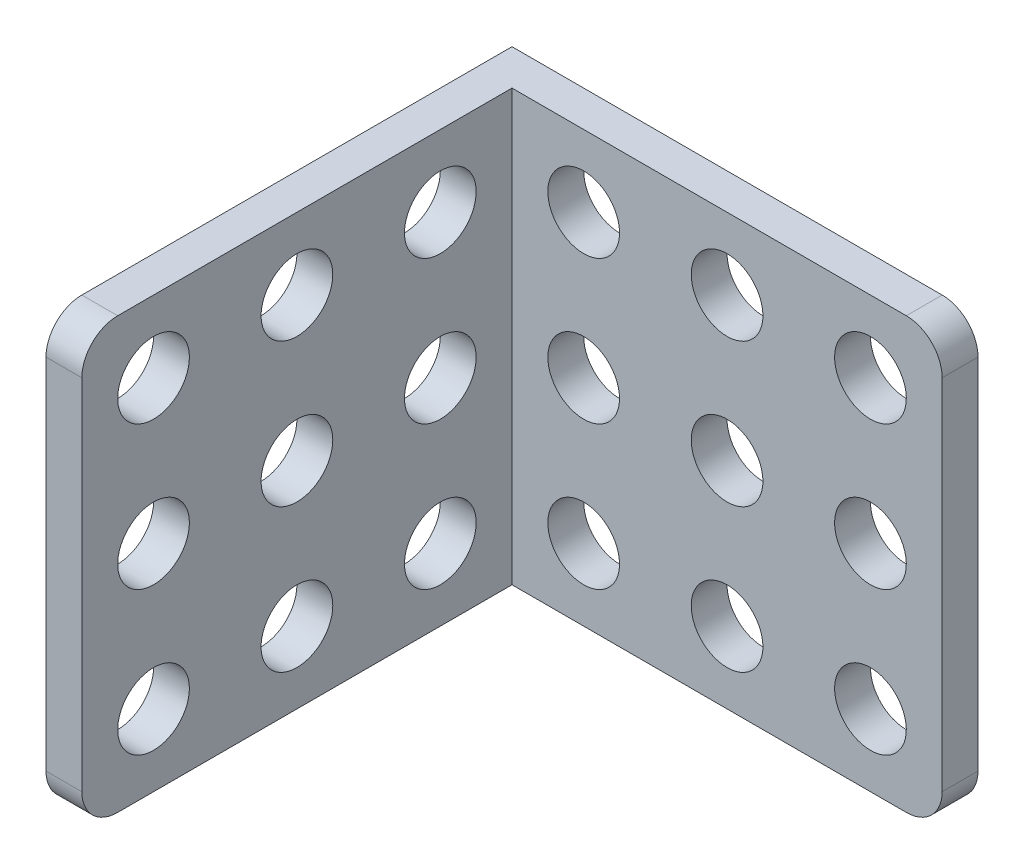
ISO-10303-21;
HEADER;
FILE_DESCRIPTION(('STEP AP214'),'2;1');
FILE_NAME('part.step','',(''),(''),'','','');
FILE_SCHEMA(('AUTOMOTIVE_DESIGN { 1 0 10303 214 1 1 1 1 }'));
ENDSEC;
DATA;
#1=APPLICATION_CONTEXT('core data for automotive mechanical design processes');
#2=APPLICATION_PROTOCOL_DEFINITION('international standard','automotive_design',2000,#1);
#3=PRODUCT_CONTEXT('',#1,'mechanical');
#4=PRODUCT('Part','Part','',(#3));
#5=PRODUCT_RELATED_PRODUCT_CATEGORY('part','',(#4));
#6=PRODUCT_DEFINITION_FORMATION('','',#4);
#7=PRODUCT_DEFINITION_CONTEXT('part definition',#1,'design');
#8=PRODUCT_DEFINITION('design','',#6,#7);
#9=PRODUCT_DEFINITION_SHAPE('','',#8);
#10=(LENGTH_UNIT() NAMED_UNIT(*) SI_UNIT(.MILLI.,.METRE.));
#11=(NAMED_UNIT(*) PLANE_ANGLE_UNIT() SI_UNIT($,.RADIAN.));
#12=(NAMED_UNIT(*) SI_UNIT($,.STERADIAN.) SOLID_ANGLE_UNIT());
#13=UNCERTAINTY_MEASURE_WITH_UNIT(LENGTH_MEASURE(1.E-05),#10,'distance_accuracy_value','');
#14=(GEOMETRIC_REPRESENTATION_CONTEXT(3) GLOBAL_UNCERTAINTY_ASSIGNED_CONTEXT((#13)) GLOBAL_UNIT_ASSIGNED_CONTEXT((#10,
#11,#12)) REPRESENTATION_CONTEXT('',''));
#15=CARTESIAN_POINT('',(0.,0.,0.));
#16=DIRECTION('',(0.,0.,1.));
#17=DIRECTION('',(1.,0.,0.));
#18=AXIS2_PLACEMENT_3D('',#15,#16,#17);
#19=CARTESIAN_POINT('',(13.,12.,2.));
#20=DIRECTION('',(-1.,0.,0.));
#21=DIRECTION('',(0.,-1.,0.));
#22=AXIS2_PLACEMENT_3D('',#19,#20,#21);
#23=PLANE('',#22);
#24=DIRECTION('',(0.,1.,0.));
#25=VECTOR('',#24,1.);
#26=CARTESIAN_POINT('',(13.,12.,2.));
#27=LINE('',#26,#25);
#28=CARTESIAN_POINT('',(13.,-10.,2.));
#29=VERTEX_POINT('',#28);
#30=CARTESIAN_POINT('',(13.,10.,2.));
#31=VERTEX_POINT('',#30);
#32=EDGE_CURVE('E134',#29,#31,#27,.T.);
#33=ORIENTED_EDGE('',*,*,#32,.F.);
#34=DIRECTION('',(0.,0.,-1.));
#35=VECTOR('',#34,1.);
#36=CARTESIAN_POINT('',(13.,-10.,2.));
#37=LINE('',#36,#35);
#38=CARTESIAN_POINT('',(13.,-10.,0.));
#39=VERTEX_POINT('',#38);
#40=EDGE_CURVE('E169',#29,#39,#37,.T.);
#41=ORIENTED_EDGE('',*,*,#40,.T.);
#42=DIRECTION('',(0.,1.,0.));
#43=VECTOR('',#42,1.);
#44=CARTESIAN_POINT('',(13.,12.,0.));
#45=LINE('',#44,#43);
#46=CARTESIAN_POINT('',(13.,10.,0.));
#47=VERTEX_POINT('',#46);
#48=EDGE_CURVE('E149',#39,#47,#45,.T.);
#49=ORIENTED_EDGE('',*,*,#48,.T.);
#50=DIRECTION('',(0.,0.,-1.));
#51=VECTOR('',#50,1.);
#52=CARTESIAN_POINT('',(13.,10.,2.));
#53=LINE('',#52,#51);
#54=EDGE_CURVE('E167',#47,#31,#53,.F.);
#55=ORIENTED_EDGE('',*,*,#54,.T.);
#56=EDGE_LOOP('',(#33,#41,#49,#55));
#57=FACE_BOUND('',#56,.T.);
#58=ADVANCED_FACE('F35',(#57),#23,.F.);
#59=CARTESIAN_POINT('',(-13.,12.,2.));
#60=DIRECTION('',(0.,-1.,0.));
#61=DIRECTION('',(0.,0.,-1.));
#62=AXIS2_PLACEMENT_3D('',#59,#60,#61);
#63=PLANE('',#62);
#64=DIRECTION('',(-1.,0.,0.));
#65=VECTOR('',#64,1.);
#66=CARTESIAN_POINT('',(-13.,12.,2.));
#67=LINE('',#66,#65);
#68=CARTESIAN_POINT('',(11.,12.,2.));
#69=VERTEX_POINT('',#68);
#70=CARTESIAN_POINT('',(-11.,12.,2.));
#71=VERTEX_POINT('',#70);
#72=EDGE_CURVE('E115',#69,#71,#67,.T.);
#73=ORIENTED_EDGE('',*,*,#72,.F.);
#74=DIRECTION('',(0.,0.,-1.));
#75=VECTOR('',#74,1.);
#76=CARTESIAN_POINT('',(11.,12.,2.));
#77=LINE('',#76,#75);
#78=CARTESIAN_POINT('',(11.,12.,0.));
#79=VERTEX_POINT('',#78);
#80=EDGE_CURVE('E184',#69,#79,#77,.T.);
#81=ORIENTED_EDGE('',*,*,#80,.T.);
#82=DIRECTION('',(-1.,0.,0.));
#83=VECTOR('',#82,1.);
#84=CARTESIAN_POINT('',(-13.,12.,0.));
#85=LINE('',#84,#83);
#86=CARTESIAN_POINT('',(-13.,12.,0.));
#87=VERTEX_POINT('',#86);
#88=EDGE_CURVE('E156',#79,#87,#85,.T.);
#89=ORIENTED_EDGE('',*,*,#88,.T.);
#90=DIRECTION('',(0.,0.,-1.));
#91=VECTOR('',#90,1.);
#92=CARTESIAN_POINT('',(-13.,12.,2.));
#93=LINE('',#92,#91);
#94=CARTESIAN_POINT('',(-13.,12.,24.));
#95=VERTEX_POINT('',#94);
#96=EDGE_CURVE('E165',#95,#87,#93,.T.);
#97=ORIENTED_EDGE('',*,*,#96,.F.);
#98=DIRECTION('',(-1.,0.,0.));
#99=VECTOR('',#98,1.);
#100=CARTESIAN_POINT('',(-11.,12.,24.));
#101=LINE('',#100,#99);
#102=CARTESIAN_POINT('',(-11.,12.,24.));
#103=VERTEX_POINT('',#102);
#104=EDGE_CURVE('E119',#95,#103,#101,.F.);
#105=ORIENTED_EDGE('',*,*,#104,.T.);
#106=DIRECTION('',(0.,0.,-1.));
#107=VECTOR('',#106,1.);
#108=CARTESIAN_POINT('',(-11.,12.,26.));
#109=LINE('',#108,#107);
#110=EDGE_CURVE('E111',#103,#71,#109,.T.);
#111=ORIENTED_EDGE('',*,*,#110,.T.);
#112=EDGE_LOOP('',(#73,#81,#89,#97,#105,#111));
#113=FACE_BOUND('',#112,.T.);
#114=ADVANCED_FACE('F113',(#113),#63,.F.);
#115=CARTESIAN_POINT('',(-13.,12.,2.));
#116=DIRECTION('',(1.,0.,0.));
#117=DIRECTION('',(0.,0.,-1.));
#118=AXIS2_PLACEMENT_3D('',#115,#116,#117);
#119=PLANE('',#118);
#120=CARTESIAN_POINT('',(-13.,0.,6.));
#121=DIRECTION('',(1.,0.,0.));
#122=DIRECTION('',(0.,0.,-1.));
#123=AXIS2_PLACEMENT_3D('',#120,#121,#122);
#124=CIRCLE('',#123,2.);
#125=CARTESIAN_POINT('',(-13.,0.,4.));
#126=VERTEX_POINT('',#125);
#127=EDGE_CURVE('E386',#126,#126,#124,.T.);
#128=ORIENTED_EDGE('',*,*,#127,.T.);
#129=EDGE_LOOP('',(#128));
#130=FACE_BOUND('',#129,.T.);
#131=CARTESIAN_POINT('',(-13.,0.,14.));
#132=DIRECTION('',(1.,0.,0.));
#133=DIRECTION('',(0.,0.,-1.));
#134=AXIS2_PLACEMENT_3D('',#131,#132,#133);
#135=CIRCLE('',#134,2.);
#136=CARTESIAN_POINT('',(-13.,0.,12.));
#137=VERTEX_POINT('',#136);
#138=EDGE_CURVE('E392',#137,#137,#135,.T.);
#139=ORIENTED_EDGE('',*,*,#138,.T.);
#140=EDGE_LOOP('',(#139));
#141=FACE_BOUND('',#140,.T.);
#142=CARTESIAN_POINT('',(-13.,0.,22.));
#143=DIRECTION('',(1.,0.,0.));
#144=DIRECTION('',(0.,0.,-1.));
#145=AXIS2_PLACEMENT_3D('',#142,#143,#144);
#146=CIRCLE('',#145,2.);
#147=CARTESIAN_POINT('',(-13.,0.,20.));
#148=VERTEX_POINT('',#147);
#149=EDGE_CURVE('E398',#148,#148,#146,.T.);
#150=ORIENTED_EDGE('',*,*,#149,.T.);
#151=EDGE_LOOP('',(#150));
#152=FACE_BOUND('',#151,.T.);
#153=CARTESIAN_POINT('',(-13.,8.,22.));
#154=DIRECTION('',(1.,0.,0.));
#155=DIRECTION('',(0.,0.,-1.));
#156=AXIS2_PLACEMENT_3D('',#153,#154,#155);
#157=CIRCLE('',#156,2.);
#158=CARTESIAN_POINT('',(-13.,8.,20.));
#159=VERTEX_POINT('',#158);
#160=EDGE_CURVE('E404',#159,#159,#157,.T.);
#161=ORIENTED_EDGE('',*,*,#160,.T.);
#162=EDGE_LOOP('',(#161));
#163=FACE_BOUND('',#162,.T.);
#164=CARTESIAN_POINT('',(-13.,8.,14.));
#165=DIRECTION('',(1.,0.,0.));
#166=DIRECTION('',(0.,0.,-1.));
#167=AXIS2_PLACEMENT_3D('',#164,#165,#166);
#168=CIRCLE('',#167,2.);
#169=CARTESIAN_POINT('',(-13.,8.,12.));
#170=VERTEX_POINT('',#169);
#171=EDGE_CURVE('E410',#170,#170,#168,.T.);
#172=ORIENTED_EDGE('',*,*,#171,.T.);
#173=EDGE_LOOP('',(#172));
#174=FACE_BOUND('',#173,.T.);
#175=CARTESIAN_POINT('',(-13.,8.,6.));
#176=DIRECTION('',(1.,0.,0.));
#177=DIRECTION('',(0.,0.,-1.));
#178=AXIS2_PLACEMENT_3D('',#175,#176,#177);
#179=CIRCLE('',#178,2.);
#180=CARTESIAN_POINT('',(-13.,8.,4.));
#181=VERTEX_POINT('',#180);
#182=EDGE_CURVE('E416',#181,#181,#179,.T.);
#183=ORIENTED_EDGE('',*,*,#182,.T.);
#184=EDGE_LOOP('',(#183));
#185=FACE_BOUND('',#184,.T.);
#186=CARTESIAN_POINT('',(-13.,-8.,6.));
#187=DIRECTION('',(1.,0.,0.));
#188=DIRECTION('',(0.,0.,-1.));
#189=AXIS2_PLACEMENT_3D('',#186,#187,#188);
#190=CIRCLE('',#189,2.);
#191=CARTESIAN_POINT('',(-13.,-8.,4.));
#192=VERTEX_POINT('',#191);
#193=EDGE_CURVE('E422',#192,#192,#190,.T.);
#194=ORIENTED_EDGE('',*,*,#193,.T.);
#195=EDGE_LOOP('',(#194));
#196=FACE_BOUND('',#195,.T.);
#197=CARTESIAN_POINT('',(-13.,-8.,14.));
#198=DIRECTION('',(1.,0.,0.));
#199=DIRECTION('',(0.,0.,-1.));
#200=AXIS2_PLACEMENT_3D('',#197,#198,#199);
#201=CIRCLE('',#200,2.);
#202=CARTESIAN_POINT('',(-13.,-8.,12.));
#203=VERTEX_POINT('',#202);
#204=EDGE_CURVE('E428',#203,#203,#201,.T.);
#205=ORIENTED_EDGE('',*,*,#204,.T.);
#206=EDGE_LOOP('',(#205));
#207=FACE_BOUND('',#206,.T.);
#208=CARTESIAN_POINT('',(-13.,-8.,22.));
#209=DIRECTION('',(1.,0.,0.));
#210=DIRECTION('',(0.,0.,-1.));
#211=AXIS2_PLACEMENT_3D('',#208,#209,#210);
#212=CIRCLE('',#211,2.);
#213=CARTESIAN_POINT('',(-13.,-8.,20.));
#214=VERTEX_POINT('',#213);
#215=EDGE_CURVE('E139',#214,#214,#212,.T.);
#216=ORIENTED_EDGE('',*,*,#215,.T.);
#217=EDGE_LOOP('',(#216));
#218=FACE_BOUND('',#217,.T.);
#219=DIRECTION('',(0.,-1.,0.));
#220=VECTOR('',#219,1.);
#221=CARTESIAN_POINT('',(-13.,12.,26.));
#222=LINE('',#221,#220);
#223=CARTESIAN_POINT('',(-13.,10.,26.));
#224=VERTEX_POINT('',#223);
#225=CARTESIAN_POINT('',(-13.,-10.,26.));
#226=VERTEX_POINT('',#225);
#227=EDGE_CURVE('E138',#224,#226,#222,.T.);
#228=ORIENTED_EDGE('',*,*,#227,.F.);
#229=CARTESIAN_POINT('',(-13.,10.,24.));
#230=DIRECTION('',(1.,0.,0.));
#231=DIRECTION('',(0.,0.,-1.));
#232=AXIS2_PLACEMENT_3D('',#229,#230,#231);
#233=CIRCLE('',#232,2.);
#234=EDGE_CURVE('E193',#224,#95,#233,.F.);
#235=ORIENTED_EDGE('',*,*,#234,.T.);
#236=ORIENTED_EDGE('',*,*,#96,.T.);
#237=DIRECTION('',(0.,-1.,0.));
#238=VECTOR('',#237,1.);
#239=CARTESIAN_POINT('',(-13.,12.,0.));
#240=LINE('',#239,#238);
#241=CARTESIAN_POINT('',(-13.,-12.,0.));
#242=VERTEX_POINT('',#241);
#243=EDGE_CURVE('E159',#87,#242,#240,.T.);
#244=ORIENTED_EDGE('',*,*,#243,.T.);
#245=DIRECTION('',(0.,0.,-1.));
#246=VECTOR('',#245,1.);
#247=CARTESIAN_POINT('',(-13.,-12.,2.));
#248=LINE('',#247,#246);
#249=CARTESIAN_POINT('',(-13.,-12.,24.));
#250=VERTEX_POINT('',#249);
#251=EDGE_CURVE('E153',#250,#242,#248,.T.);
#252=ORIENTED_EDGE('',*,*,#251,.F.);
#253=CARTESIAN_POINT('',(-13.,-10.,24.));
#254=DIRECTION('',(1.,0.,0.));
#255=DIRECTION('',(0.,0.,-1.));
#256=AXIS2_PLACEMENT_3D('',#253,#254,#255);
#257=CIRCLE('',#256,2.);
#258=EDGE_CURVE('E191',#250,#226,#257,.F.);
#259=ORIENTED_EDGE('',*,*,#258,.T.);
#260=EDGE_LOOP('',(#228,#235,#236,#244,#252,#259));
#261=FACE_BOUND('',#260,.T.);
#262=ADVANCED_FACE('F200',(#130,#141,#152,#163,#174,#185,#196,#207,#218,#261),#119,.F.);
#263=CARTESIAN_POINT('',(-13.,-12.,2.));
#264=DIRECTION('',(0.,1.,0.));
#265=DIRECTION('',(0.,0.,1.));
#266=AXIS2_PLACEMENT_3D('',#263,#264,#265);
#267=PLANE('',#266);
#268=DIRECTION('',(1.,0.,0.));
#269=VECTOR('',#268,1.);
#270=CARTESIAN_POINT('',(-13.,-12.,0.));
#271=LINE('',#270,#269);
#272=CARTESIAN_POINT('',(11.,-12.,0.));
#273=VERTEX_POINT('',#272);
#274=EDGE_CURVE('E150',#242,#273,#271,.T.);
#275=ORIENTED_EDGE('',*,*,#274,.T.);
#276=DIRECTION('',(0.,0.,-1.));
#277=VECTOR('',#276,1.);
#278=CARTESIAN_POINT('',(11.,-12.,2.));
#279=LINE('',#278,#277);
#280=CARTESIAN_POINT('',(11.,-12.,2.));
#281=VERTEX_POINT('',#280);
#282=EDGE_CURVE('E178',#273,#281,#279,.F.);
#283=ORIENTED_EDGE('',*,*,#282,.T.);
#284=DIRECTION('',(1.,0.,0.));
#285=VECTOR('',#284,1.);
#286=CARTESIAN_POINT('',(-13.,-12.,2.));
#287=LINE('',#286,#285);
#288=CARTESIAN_POINT('',(-11.,-12.,2.));
#289=VERTEX_POINT('',#288);
#290=EDGE_CURVE('E133',#289,#281,#287,.T.);
#291=ORIENTED_EDGE('',*,*,#290,.F.);
#292=DIRECTION('',(0.,0.,-1.));
#293=VECTOR('',#292,1.);
#294=CARTESIAN_POINT('',(-11.,-12.,26.));
#295=LINE('',#294,#293);
#296=CARTESIAN_POINT('',(-11.,-12.,24.));
#297=VERTEX_POINT('',#296);
#298=EDGE_CURVE('E121',#297,#289,#295,.T.);
#299=ORIENTED_EDGE('',*,*,#298,.F.);
#300=DIRECTION('',(1.,0.,0.));
#301=VECTOR('',#300,1.);
#302=CARTESIAN_POINT('',(-13.,-12.,24.));
#303=LINE('',#302,#301);
#304=EDGE_CURVE('E176',#297,#250,#303,.F.);
#305=ORIENTED_EDGE('',*,*,#304,.T.);
#306=ORIENTED_EDGE('',*,*,#251,.T.);
#307=EDGE_LOOP('',(#275,#283,#291,#299,#305,#306));
#308=FACE_BOUND('',#307,.T.);
#309=ADVANCED_FACE('F195',(#308),#267,.F.);
#310=CARTESIAN_POINT('',(0.,0.,2.));
#311=DIRECTION('',(0.,0.,1.));
#312=DIRECTION('',(1.,0.,0.));
#313=AXIS2_PLACEMENT_3D('',#310,#311,#312);
#314=PLANE('',#313);
#315=CARTESIAN_POINT('',(-7.,0.,2.));
#316=DIRECTION('',(0.,0.,1.));
#317=DIRECTION('',(0.,-1.,0.));
#318=AXIS2_PLACEMENT_3D('',#315,#316,#317);
#319=CIRCLE('',#318,1.99999999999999);
#320=CARTESIAN_POINT('',(-7.,-1.99999999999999,2.));
#321=VERTEX_POINT('',#320);
#322=EDGE_CURVE('E331',#321,#321,#319,.T.);
#323=ORIENTED_EDGE('',*,*,#322,.F.);
#324=EDGE_LOOP('',(#323));
#325=FACE_BOUND('',#324,.T.);
#326=CARTESIAN_POINT('',(0.999999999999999,0.,2.));
#327=DIRECTION('',(0.,0.,1.));
#328=DIRECTION('',(0.,-1.,0.));
#329=AXIS2_PLACEMENT_3D('',#326,#327,#328);
#330=CIRCLE('',#329,1.99999999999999);
#331=CARTESIAN_POINT('',(0.999999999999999,-1.99999999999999,2.));
#332=VERTEX_POINT('',#331);
#333=EDGE_CURVE('E333',#332,#332,#330,.T.);
#334=ORIENTED_EDGE('',*,*,#333,.F.);
#335=EDGE_LOOP('',(#334));
#336=FACE_BOUND('',#335,.T.);
#337=CARTESIAN_POINT('',(9.,0.,2.));
#338=DIRECTION('',(0.,0.,1.));
#339=DIRECTION('',(0.,-1.,0.));
#340=AXIS2_PLACEMENT_3D('',#337,#338,#339);
#341=CIRCLE('',#340,1.99999999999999);
#342=CARTESIAN_POINT('',(9.,-1.99999999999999,2.));
#343=VERTEX_POINT('',#342);
#344=EDGE_CURVE('E341',#343,#343,#341,.T.);
#345=ORIENTED_EDGE('',*,*,#344,.F.);
#346=EDGE_LOOP('',(#345));
#347=FACE_BOUND('',#346,.T.);
#348=CARTESIAN_POINT('',(9.,8.,2.));
#349=DIRECTION('',(0.,0.,1.));
#350=DIRECTION('',(0.,-1.,0.));
#351=AXIS2_PLACEMENT_3D('',#348,#349,#350);
#352=CIRCLE('',#351,1.99999999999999);
#353=CARTESIAN_POINT('',(9.,6.00000000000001,2.));
#354=VERTEX_POINT('',#353);
#355=EDGE_CURVE('E347',#354,#354,#352,.T.);
#356=ORIENTED_EDGE('',*,*,#355,.F.);
#357=EDGE_LOOP('',(#356));
#358=FACE_BOUND('',#357,.T.);
#359=CARTESIAN_POINT('',(0.999999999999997,8.,2.));
#360=DIRECTION('',(0.,0.,1.));
#361=DIRECTION('',(0.,-1.,0.));
#362=AXIS2_PLACEMENT_3D('',#359,#360,#361);
#363=CIRCLE('',#362,1.99999999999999);
#364=CARTESIAN_POINT('',(0.999999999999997,6.00000000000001,2.));
#365=VERTEX_POINT('',#364);
#366=EDGE_CURVE('E353',#365,#365,#363,.T.);
#367=ORIENTED_EDGE('',*,*,#366,.F.);
#368=EDGE_LOOP('',(#367));
#369=FACE_BOUND('',#368,.T.);
#370=CARTESIAN_POINT('',(-7.,8.,2.));
#371=DIRECTION('',(0.,0.,1.));
#372=DIRECTION('',(0.,-1.,0.));
#373=AXIS2_PLACEMENT_3D('',#370,#371,#372);
#374=CIRCLE('',#373,1.99999999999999);
#375=CARTESIAN_POINT('',(-7.,6.00000000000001,2.));
#376=VERTEX_POINT('',#375);
#377=EDGE_CURVE('E359',#376,#376,#374,.T.);
#378=ORIENTED_EDGE('',*,*,#377,.F.);
#379=EDGE_LOOP('',(#378));
#380=FACE_BOUND('',#379,.T.);
#381=CARTESIAN_POINT('',(-7.,-8.,2.));
#382=DIRECTION('',(0.,0.,1.));
#383=DIRECTION('',(0.,-1.,0.));
#384=AXIS2_PLACEMENT_3D('',#381,#382,#383);
#385=CIRCLE('',#384,1.99999999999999);
#386=CARTESIAN_POINT('',(-7.,-9.99999999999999,2.));
#387=VERTEX_POINT('',#386);
#388=EDGE_CURVE('E365',#387,#387,#385,.T.);
#389=ORIENTED_EDGE('',*,*,#388,.F.);
#390=EDGE_LOOP('',(#389));
#391=FACE_BOUND('',#390,.T.);
#392=CARTESIAN_POINT('',(0.999999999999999,-8.,2.));
#393=DIRECTION('',(0.,0.,1.));
#394=DIRECTION('',(0.,-1.,0.));
#395=AXIS2_PLACEMENT_3D('',#392,#393,#394);
#396=CIRCLE('',#395,1.99999999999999);
#397=CARTESIAN_POINT('',(0.999999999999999,-9.99999999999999,2.));
#398=VERTEX_POINT('',#397);
#399=EDGE_CURVE('E371',#398,#398,#396,.T.);
#400=ORIENTED_EDGE('',*,*,#399,.F.);
#401=EDGE_LOOP('',(#400));
#402=FACE_BOUND('',#401,.T.);
#403=CARTESIAN_POINT('',(9.,-8.,2.));
#404=DIRECTION('',(0.,0.,1.));
#405=DIRECTION('',(0.,-1.,0.));
#406=AXIS2_PLACEMENT_3D('',#403,#404,#405);
#407=CIRCLE('',#406,1.99999999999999);
#408=CARTESIAN_POINT('',(9.,-9.99999999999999,2.));
#409=VERTEX_POINT('',#408);
#410=EDGE_CURVE('E377',#409,#409,#407,.T.);
#411=ORIENTED_EDGE('',*,*,#410,.F.);
#412=EDGE_LOOP('',(#411));
#413=FACE_BOUND('',#412,.T.);
#414=ORIENTED_EDGE('',*,*,#290,.T.);
#415=CARTESIAN_POINT('',(11.,-10.,2.));
#416=DIRECTION('',(0.,0.,1.));
#417=DIRECTION('',(1.,0.,0.));
#418=AXIS2_PLACEMENT_3D('',#415,#416,#417);
#419=CIRCLE('',#418,2.);
#420=EDGE_CURVE('E181',#281,#29,#419,.T.);
#421=ORIENTED_EDGE('',*,*,#420,.T.);
#422=ORIENTED_EDGE('',*,*,#32,.T.);
#423=CARTESIAN_POINT('',(11.,10.,2.));
#424=DIRECTION('',(0.,0.,1.));
#425=DIRECTION('',(1.,0.,0.));
#426=AXIS2_PLACEMENT_3D('',#423,#424,#425);
#427=CIRCLE('',#426,2.);
#428=EDGE_CURVE('E132',#31,#69,#427,.T.);
#429=ORIENTED_EDGE('',*,*,#428,.T.);
#430=ORIENTED_EDGE('',*,*,#72,.T.);
#431=DIRECTION('',(0.,1.,0.));
#432=VECTOR('',#431,1.);
#433=CARTESIAN_POINT('',(-11.,12.,2.));
#434=LINE('',#433,#432);
#435=EDGE_CURVE('E128',#289,#71,#434,.T.);
#436=ORIENTED_EDGE('',*,*,#435,.F.);
#437=EDGE_LOOP('',(#414,#421,#422,#429,#430,#436));
#438=FACE_BOUND('',#437,.T.);
#439=ADVANCED_FACE('F127',(#325,#336,#347,#358,#369,#380,#391,#402,#413,#438),#314,.T.);
#440=CARTESIAN_POINT('',(0.,0.,0.));
#441=DIRECTION('',(0.,0.,1.));
#442=DIRECTION('',(1.,0.,0.));
#443=AXIS2_PLACEMENT_3D('',#440,#441,#442);
#444=PLANE('',#443);
#445=CARTESIAN_POINT('',(-7.,0.,0.));
#446=DIRECTION('',(0.,0.,1.));
#447=DIRECTION('',(0.,-1.,0.));
#448=AXIS2_PLACEMENT_3D('',#445,#446,#447);
#449=CIRCLE('',#448,2.);
#450=CARTESIAN_POINT('',(-7.,-2.,0.));
#451=VERTEX_POINT('',#450);
#452=EDGE_CURVE('E328',#451,#451,#449,.T.);
#453=ORIENTED_EDGE('',*,*,#452,.T.);
#454=EDGE_LOOP('',(#453));
#455=FACE_BOUND('',#454,.T.);
#456=CARTESIAN_POINT('',(0.999999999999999,0.,0.));
#457=DIRECTION('',(0.,0.,1.));
#458=DIRECTION('',(0.,-1.,0.));
#459=AXIS2_PLACEMENT_3D('',#456,#457,#458);
#460=CIRCLE('',#459,2.);
#461=CARTESIAN_POINT('',(0.999999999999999,-2.,0.));
#462=VERTEX_POINT('',#461);
#463=EDGE_CURVE('E338',#462,#462,#460,.T.);
#464=ORIENTED_EDGE('',*,*,#463,.T.);
#465=EDGE_LOOP('',(#464));
#466=FACE_BOUND('',#465,.T.);
#467=CARTESIAN_POINT('',(9.,0.,0.));
#468=DIRECTION('',(0.,0.,1.));
#469=DIRECTION('',(0.,-1.,0.));
#470=AXIS2_PLACEMENT_3D('',#467,#468,#469);
#471=CIRCLE('',#470,2.);
#472=CARTESIAN_POINT('',(9.,-2.,0.));
#473=VERTEX_POINT('',#472);
#474=EDGE_CURVE('E344',#473,#473,#471,.T.);
#475=ORIENTED_EDGE('',*,*,#474,.T.);
#476=EDGE_LOOP('',(#475));
#477=FACE_BOUND('',#476,.T.);
#478=CARTESIAN_POINT('',(9.,8.,0.));
#479=DIRECTION('',(0.,0.,1.));
#480=DIRECTION('',(0.,-1.,0.));
#481=AXIS2_PLACEMENT_3D('',#478,#479,#480);
#482=CIRCLE('',#481,2.);
#483=CARTESIAN_POINT('',(9.,6.,0.));
#484=VERTEX_POINT('',#483);
#485=EDGE_CURVE('E350',#484,#484,#482,.T.);
#486=ORIENTED_EDGE('',*,*,#485,.T.);
#487=EDGE_LOOP('',(#486));
#488=FACE_BOUND('',#487,.T.);
#489=CARTESIAN_POINT('',(0.999999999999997,8.,0.));
#490=DIRECTION('',(0.,0.,1.));
#491=DIRECTION('',(0.,-1.,0.));
#492=AXIS2_PLACEMENT_3D('',#489,#490,#491);
#493=CIRCLE('',#492,2.);
#494=CARTESIAN_POINT('',(0.999999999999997,6.,0.));
#495=VERTEX_POINT('',#494);
#496=EDGE_CURVE('E356',#495,#495,#493,.T.);
#497=ORIENTED_EDGE('',*,*,#496,.T.);
#498=EDGE_LOOP('',(#497));
#499=FACE_BOUND('',#498,.T.);
#500=CARTESIAN_POINT('',(-7.,8.,0.));
#501=DIRECTION('',(0.,0.,1.));
#502=DIRECTION('',(0.,-1.,0.));
#503=AXIS2_PLACEMENT_3D('',#500,#501,#502);
#504=CIRCLE('',#503,2.);
#505=CARTESIAN_POINT('',(-7.,6.,0.));
#506=VERTEX_POINT('',#505);
#507=EDGE_CURVE('E362',#506,#506,#504,.T.);
#508=ORIENTED_EDGE('',*,*,#507,.T.);
#509=EDGE_LOOP('',(#508));
#510=FACE_BOUND('',#509,.T.);
#511=CARTESIAN_POINT('',(-7.,-8.,0.));
#512=DIRECTION('',(0.,0.,1.));
#513=DIRECTION('',(0.,-1.,0.));
#514=AXIS2_PLACEMENT_3D('',#511,#512,#513);
#515=CIRCLE('',#514,2.);
#516=CARTESIAN_POINT('',(-7.,-10.,0.));
#517=VERTEX_POINT('',#516);
#518=EDGE_CURVE('E368',#517,#517,#515,.T.);
#519=ORIENTED_EDGE('',*,*,#518,.T.);
#520=EDGE_LOOP('',(#519));
#521=FACE_BOUND('',#520,.T.);
#522=CARTESIAN_POINT('',(0.999999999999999,-8.,0.));
#523=DIRECTION('',(0.,0.,1.));
#524=DIRECTION('',(0.,-1.,0.));
#525=AXIS2_PLACEMENT_3D('',#522,#523,#524);
#526=CIRCLE('',#525,2.);
#527=CARTESIAN_POINT('',(0.999999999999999,-10.,0.));
#528=VERTEX_POINT('',#527);
#529=EDGE_CURVE('E374',#528,#528,#526,.T.);
#530=ORIENTED_EDGE('',*,*,#529,.T.);
#531=EDGE_LOOP('',(#530));
#532=FACE_BOUND('',#531,.T.);
#533=CARTESIAN_POINT('',(9.,-8.,0.));
#534=DIRECTION('',(0.,0.,1.));
#535=DIRECTION('',(0.,-1.,0.));
#536=AXIS2_PLACEMENT_3D('',#533,#534,#535);
#537=CIRCLE('',#536,2.);
#538=CARTESIAN_POINT('',(9.,-10.,0.));
#539=VERTEX_POINT('',#538);
#540=EDGE_CURVE('E380',#539,#539,#537,.T.);
#541=ORIENTED_EDGE('',*,*,#540,.T.);
#542=EDGE_LOOP('',(#541));
#543=FACE_BOUND('',#542,.T.);
#544=ORIENTED_EDGE('',*,*,#48,.F.);
#545=CARTESIAN_POINT('',(11.,-10.,0.));
#546=DIRECTION('',(0.,0.,1.));
#547=DIRECTION('',(1.,0.,0.));
#548=AXIS2_PLACEMENT_3D('',#545,#546,#547);
#549=CIRCLE('',#548,2.);
#550=EDGE_CURVE('E174',#39,#273,#549,.F.);
#551=ORIENTED_EDGE('',*,*,#550,.T.);
#552=ORIENTED_EDGE('',*,*,#274,.F.);
#553=ORIENTED_EDGE('',*,*,#243,.F.);
#554=ORIENTED_EDGE('',*,*,#88,.F.);
#555=CARTESIAN_POINT('',(11.,10.,0.));
#556=DIRECTION('',(0.,0.,1.));
#557=DIRECTION('',(1.,0.,0.));
#558=AXIS2_PLACEMENT_3D('',#555,#556,#557);
#559=CIRCLE('',#558,2.);
#560=EDGE_CURVE('E172',#79,#47,#559,.F.);
#561=ORIENTED_EDGE('',*,*,#560,.T.);
#562=EDGE_LOOP('',(#544,#551,#552,#553,#554,#561));
#563=FACE_BOUND('',#562,.T.);
#564=ADVANCED_FACE('F211',(#455,#466,#477,#488,#499,#510,#521,#532,#543,#563),#444,.F.);
#565=CARTESIAN_POINT('',(-11.,12.,26.));
#566=DIRECTION('',(-1.,0.,0.));
#567=DIRECTION('',(0.,-1.,0.));
#568=AXIS2_PLACEMENT_3D('',#565,#566,#567);
#569=PLANE('',#568);
#570=CARTESIAN_POINT('',(-11.,0.,6.));
#571=DIRECTION('',(1.,0.,0.));
#572=DIRECTION('',(0.,0.,-1.));
#573=AXIS2_PLACEMENT_3D('',#570,#571,#572);
#574=CIRCLE('',#573,1.99999999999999);
#575=CARTESIAN_POINT('',(-11.,0.,4.00000000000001));
#576=VERTEX_POINT('',#575);
#577=EDGE_CURVE('E383',#576,#576,#574,.T.);
#578=ORIENTED_EDGE('',*,*,#577,.F.);
#579=EDGE_LOOP('',(#578));
#580=FACE_BOUND('',#579,.T.);
#581=CARTESIAN_POINT('',(-11.,0.,14.));
#582=DIRECTION('',(1.,0.,0.));
#583=DIRECTION('',(0.,0.,-1.));
#584=AXIS2_PLACEMENT_3D('',#581,#582,#583);
#585=CIRCLE('',#584,1.99999999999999);
#586=CARTESIAN_POINT('',(-11.,0.,12.));
#587=VERTEX_POINT('',#586);
#588=EDGE_CURVE('E389',#587,#587,#585,.T.);
#589=ORIENTED_EDGE('',*,*,#588,.F.);
#590=EDGE_LOOP('',(#589));
#591=FACE_BOUND('',#590,.T.);
#592=CARTESIAN_POINT('',(-11.,0.,22.));
#593=DIRECTION('',(1.,0.,0.));
#594=DIRECTION('',(0.,0.,-1.));
#595=AXIS2_PLACEMENT_3D('',#592,#593,#594);
#596=CIRCLE('',#595,1.99999999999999);
#597=CARTESIAN_POINT('',(-11.,0.,20.));
#598=VERTEX_POINT('',#597);
#599=EDGE_CURVE('E395',#598,#598,#596,.T.);
#600=ORIENTED_EDGE('',*,*,#599,.F.);
#601=EDGE_LOOP('',(#600));
#602=FACE_BOUND('',#601,.T.);
#603=CARTESIAN_POINT('',(-11.,8.,22.));
#604=DIRECTION('',(1.,0.,0.));
#605=DIRECTION('',(0.,0.,-1.));
#606=AXIS2_PLACEMENT_3D('',#603,#604,#605);
#607=CIRCLE('',#606,1.99999999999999);
#608=CARTESIAN_POINT('',(-11.,8.,20.));
#609=VERTEX_POINT('',#608);
#610=EDGE_CURVE('E401',#609,#609,#607,.T.);
#611=ORIENTED_EDGE('',*,*,#610,.F.);
#612=EDGE_LOOP('',(#611));
#613=FACE_BOUND('',#612,.T.);
#614=CARTESIAN_POINT('',(-11.,8.,14.));
#615=DIRECTION('',(1.,0.,0.));
#616=DIRECTION('',(0.,0.,-1.));
#617=AXIS2_PLACEMENT_3D('',#614,#615,#616);
#618=CIRCLE('',#617,1.99999999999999);
#619=CARTESIAN_POINT('',(-11.,8.,12.));
#620=VERTEX_POINT('',#619);
#621=EDGE_CURVE('E407',#620,#620,#618,.T.);
#622=ORIENTED_EDGE('',*,*,#621,.F.);
#623=EDGE_LOOP('',(#622));
#624=FACE_BOUND('',#623,.T.);
#625=CARTESIAN_POINT('',(-11.,8.,6.));
#626=DIRECTION('',(1.,0.,0.));
#627=DIRECTION('',(0.,0.,-1.));
#628=AXIS2_PLACEMENT_3D('',#625,#626,#627);
#629=CIRCLE('',#628,1.99999999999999);
#630=CARTESIAN_POINT('',(-11.,8.,4.00000000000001));
#631=VERTEX_POINT('',#630);
#632=EDGE_CURVE('E413',#631,#631,#629,.T.);
#633=ORIENTED_EDGE('',*,*,#632,.F.);
#634=EDGE_LOOP('',(#633));
#635=FACE_BOUND('',#634,.T.);
#636=CARTESIAN_POINT('',(-11.,-8.,6.));
#637=DIRECTION('',(1.,0.,0.));
#638=DIRECTION('',(0.,0.,-1.));
#639=AXIS2_PLACEMENT_3D('',#636,#637,#638);
#640=CIRCLE('',#639,1.99999999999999);
#641=CARTESIAN_POINT('',(-11.,-8.,4.00000000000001));
#642=VERTEX_POINT('',#641);
#643=EDGE_CURVE('E419',#642,#642,#640,.T.);
#644=ORIENTED_EDGE('',*,*,#643,.F.);
#645=EDGE_LOOP('',(#644));
#646=FACE_BOUND('',#645,.T.);
#647=CARTESIAN_POINT('',(-11.,-8.,14.));
#648=DIRECTION('',(1.,0.,0.));
#649=DIRECTION('',(0.,0.,-1.));
#650=AXIS2_PLACEMENT_3D('',#647,#648,#649);
#651=CIRCLE('',#650,1.99999999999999);
#652=CARTESIAN_POINT('',(-11.,-8.,12.));
#653=VERTEX_POINT('',#652);
#654=EDGE_CURVE('E425',#653,#653,#651,.T.);
#655=ORIENTED_EDGE('',*,*,#654,.F.);
#656=EDGE_LOOP('',(#655));
#657=FACE_BOUND('',#656,.T.);
#658=CARTESIAN_POINT('',(-11.,-8.,22.));
#659=DIRECTION('',(1.,0.,0.));
#660=DIRECTION('',(0.,0.,-1.));
#661=AXIS2_PLACEMENT_3D('',#658,#659,#660);
#662=CIRCLE('',#661,1.99999999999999);
#663=CARTESIAN_POINT('',(-11.,-8.,20.));
#664=VERTEX_POINT('',#663);
#665=EDGE_CURVE('E144',#664,#664,#662,.T.);
#666=ORIENTED_EDGE('',*,*,#665,.F.);
#667=EDGE_LOOP('',(#666));
#668=FACE_BOUND('',#667,.T.);
#669=ORIENTED_EDGE('',*,*,#110,.F.);
#670=CARTESIAN_POINT('',(-11.,10.,24.));
#671=DIRECTION('',(-1.,0.,0.));
#672=DIRECTION('',(0.,-1.,0.));
#673=AXIS2_PLACEMENT_3D('',#670,#671,#672);
#674=CIRCLE('',#673,2.);
#675=CARTESIAN_POINT('',(-11.,10.,26.));
#676=VERTEX_POINT('',#675);
#677=EDGE_CURVE('E11',#103,#676,#674,.F.);
#678=ORIENTED_EDGE('',*,*,#677,.T.);
#679=DIRECTION('',(0.,1.,0.));
#680=VECTOR('',#679,1.);
#681=CARTESIAN_POINT('',(-11.,12.,26.));
#682=LINE('',#681,#680);
#683=CARTESIAN_POINT('',(-11.,-10.,26.));
#684=VERTEX_POINT('',#683);
#685=EDGE_CURVE('E122',#684,#676,#682,.T.);
#686=ORIENTED_EDGE('',*,*,#685,.F.);
#687=CARTESIAN_POINT('',(-11.,-10.,24.));
#688=DIRECTION('',(-1.,0.,0.));
#689=DIRECTION('',(0.,-1.,0.));
#690=AXIS2_PLACEMENT_3D('',#687,#688,#689);
#691=CIRCLE('',#690,2.);
#692=EDGE_CURVE('E43',#684,#297,#691,.F.);
#693=ORIENTED_EDGE('',*,*,#692,.T.);
#694=ORIENTED_EDGE('',*,*,#298,.T.);
#695=ORIENTED_EDGE('',*,*,#435,.T.);
#696=EDGE_LOOP('',(#669,#678,#686,#693,#694,#695));
#697=FACE_BOUND('',#696,.T.);
#698=ADVANCED_FACE('F136',(#580,#591,#602,#613,#624,#635,#646,#657,#668,#697),#569,.F.);
#699=CARTESIAN_POINT('',(0.,0.,26.));
#700=DIRECTION('',(0.,0.,1.));
#701=DIRECTION('',(1.,0.,0.));
#702=AXIS2_PLACEMENT_3D('',#699,#700,#701);
#703=PLANE('',#702);
#704=ORIENTED_EDGE('',*,*,#685,.T.);
#705=DIRECTION('',(-1.,0.,0.));
#706=VECTOR('',#705,1.);
#707=CARTESIAN_POINT('',(-13.,10.,26.));
#708=LINE('',#707,#706);
#709=EDGE_CURVE('E188',#676,#224,#708,.T.);
#710=ORIENTED_EDGE('',*,*,#709,.T.);
#711=ORIENTED_EDGE('',*,*,#227,.T.);
#712=DIRECTION('',(1.,0.,0.));
#713=VECTOR('',#712,1.);
#714=CARTESIAN_POINT('',(-11.,-10.,26.));
#715=LINE('',#714,#713);
#716=EDGE_CURVE('E186',#226,#684,#715,.T.);
#717=ORIENTED_EDGE('',*,*,#716,.T.);
#718=EDGE_LOOP('',(#704,#710,#711,#717));
#719=FACE_BOUND('',#718,.T.);
#720=ADVANCED_FACE('F202',(#719),#703,.T.);
#721=CARTESIAN_POINT('',(11.,-10.,2.));
#722=DIRECTION('',(0.,0.,-1.));
#723=DIRECTION('',(-1.,0.,0.));
#724=AXIS2_PLACEMENT_3D('',#721,#722,#723);
#725=CYLINDRICAL_SURFACE('',#724,2.);
#726=ORIENTED_EDGE('',*,*,#420,.F.);
#727=ORIENTED_EDGE('',*,*,#282,.F.);
#728=ORIENTED_EDGE('',*,*,#550,.F.);
#729=ORIENTED_EDGE('',*,*,#40,.F.);
#730=EDGE_LOOP('',(#726,#727,#728,#729));
#731=FACE_BOUND('',#730,.T.);
#732=ADVANCED_FACE('F215',(#731),#725,.T.);
#733=CARTESIAN_POINT('',(11.,10.,2.));
#734=DIRECTION('',(0.,0.,-1.));
#735=DIRECTION('',(-1.,0.,0.));
#736=AXIS2_PLACEMENT_3D('',#733,#734,#735);
#737=CYLINDRICAL_SURFACE('',#736,2.);
#738=ORIENTED_EDGE('',*,*,#428,.F.);
#739=ORIENTED_EDGE('',*,*,#54,.F.);
#740=ORIENTED_EDGE('',*,*,#560,.F.);
#741=ORIENTED_EDGE('',*,*,#80,.F.);
#742=EDGE_LOOP('',(#738,#739,#740,#741));
#743=FACE_BOUND('',#742,.T.);
#744=ADVANCED_FACE('F221',(#743),#737,.T.);
#745=CARTESIAN_POINT('',(0.,10.,24.));
#746=DIRECTION('',(1.,0.,0.));
#747=DIRECTION('',(0.,0.,-1.));
#748=AXIS2_PLACEMENT_3D('',#745,#746,#747);
#749=CYLINDRICAL_SURFACE('',#748,2.);
#750=ORIENTED_EDGE('',*,*,#677,.F.);
#751=ORIENTED_EDGE('',*,*,#104,.F.);
#752=ORIENTED_EDGE('',*,*,#234,.F.);
#753=ORIENTED_EDGE('',*,*,#709,.F.);
#754=EDGE_LOOP('',(#750,#751,#752,#753));
#755=FACE_BOUND('',#754,.T.);
#756=ADVANCED_FACE('F205',(#755),#749,.T.);
#757=CARTESIAN_POINT('',(0.,-10.,24.));
#758=DIRECTION('',(-1.,0.,0.));
#759=DIRECTION('',(0.,0.,1.));
#760=AXIS2_PLACEMENT_3D('',#757,#758,#759);
#761=CYLINDRICAL_SURFACE('',#760,2.);
#762=ORIENTED_EDGE('',*,*,#258,.F.);
#763=ORIENTED_EDGE('',*,*,#304,.F.);
#764=ORIENTED_EDGE('',*,*,#692,.F.);
#765=ORIENTED_EDGE('',*,*,#716,.F.);
#766=EDGE_LOOP('',(#762,#763,#764,#765));
#767=FACE_BOUND('',#766,.T.);
#768=ADVANCED_FACE('F37',(#767),#761,.T.);
#769=CARTESIAN_POINT('',(-11.,-8.,22.));
#770=DIRECTION('',(1.,0.,0.));
#771=DIRECTION('',(0.,0.,-1.));
#772=AXIS2_PLACEMENT_3D('',#769,#770,#771);
#773=CYLINDRICAL_SURFACE('',#772,1.99999999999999);
#774=ORIENTED_EDGE('',*,*,#215,.F.);
#775=EDGE_LOOP('',(#774));
#776=FACE_BOUND('',#775,.T.);
#777=ORIENTED_EDGE('',*,*,#665,.T.);
#778=EDGE_LOOP('',(#777));
#779=FACE_BOUND('',#778,.T.);
#780=ADVANCED_FACE('F252',(#776,#779),#773,.F.);
#781=CARTESIAN_POINT('',(-11.,-8.,14.));
#782=DIRECTION('',(1.,0.,0.));
#783=DIRECTION('',(0.,0.,-1.));
#784=AXIS2_PLACEMENT_3D('',#781,#782,#783);
#785=CYLINDRICAL_SURFACE('',#784,1.99999999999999);
#786=ORIENTED_EDGE('',*,*,#204,.F.);
#787=EDGE_LOOP('',(#786));
#788=FACE_BOUND('',#787,.T.);
#789=ORIENTED_EDGE('',*,*,#654,.T.);
#790=EDGE_LOOP('',(#789));
#791=FACE_BOUND('',#790,.T.);
#792=ADVANCED_FACE('F255',(#788,#791),#785,.F.);
#793=CARTESIAN_POINT('',(-11.,-8.,6.));
#794=DIRECTION('',(1.,0.,0.));
#795=DIRECTION('',(0.,0.,-1.));
#796=AXIS2_PLACEMENT_3D('',#793,#794,#795);
#797=CYLINDRICAL_SURFACE('',#796,1.99999999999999);
#798=ORIENTED_EDGE('',*,*,#193,.F.);
#799=EDGE_LOOP('',(#798));
#800=FACE_BOUND('',#799,.T.);
#801=ORIENTED_EDGE('',*,*,#643,.T.);
#802=EDGE_LOOP('',(#801));
#803=FACE_BOUND('',#802,.T.);
#804=ADVANCED_FACE('F259',(#800,#803),#797,.F.);
#805=CARTESIAN_POINT('',(-11.,8.,6.));
#806=DIRECTION('',(1.,0.,0.));
#807=DIRECTION('',(0.,0.,-1.));
#808=AXIS2_PLACEMENT_3D('',#805,#806,#807);
#809=CYLINDRICAL_SURFACE('',#808,1.99999999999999);
#810=ORIENTED_EDGE('',*,*,#182,.F.);
#811=EDGE_LOOP('',(#810));
#812=FACE_BOUND('',#811,.T.);
#813=ORIENTED_EDGE('',*,*,#632,.T.);
#814=EDGE_LOOP('',(#813));
#815=FACE_BOUND('',#814,.T.);
#816=ADVANCED_FACE('F263',(#812,#815),#809,.F.);
#817=CARTESIAN_POINT('',(-11.,8.,14.));
#818=DIRECTION('',(1.,0.,0.));
#819=DIRECTION('',(0.,0.,-1.));
#820=AXIS2_PLACEMENT_3D('',#817,#818,#819);
#821=CYLINDRICAL_SURFACE('',#820,1.99999999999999);
#822=ORIENTED_EDGE('',*,*,#171,.F.);
#823=EDGE_LOOP('',(#822));
#824=FACE_BOUND('',#823,.T.);
#825=ORIENTED_EDGE('',*,*,#621,.T.);
#826=EDGE_LOOP('',(#825));
#827=FACE_BOUND('',#826,.T.);
#828=ADVANCED_FACE('F267',(#824,#827),#821,.F.);
#829=CARTESIAN_POINT('',(-11.,8.,22.));
#830=DIRECTION('',(1.,0.,0.));
#831=DIRECTION('',(0.,0.,-1.));
#832=AXIS2_PLACEMENT_3D('',#829,#830,#831);
#833=CYLINDRICAL_SURFACE('',#832,1.99999999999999);
#834=ORIENTED_EDGE('',*,*,#160,.F.);
#835=EDGE_LOOP('',(#834));
#836=FACE_BOUND('',#835,.T.);
#837=ORIENTED_EDGE('',*,*,#610,.T.);
#838=EDGE_LOOP('',(#837));
#839=FACE_BOUND('',#838,.T.);
#840=ADVANCED_FACE('F271',(#836,#839),#833,.F.);
#841=CARTESIAN_POINT('',(-11.,0.,22.));
#842=DIRECTION('',(1.,0.,0.));
#843=DIRECTION('',(0.,0.,-1.));
#844=AXIS2_PLACEMENT_3D('',#841,#842,#843);
#845=CYLINDRICAL_SURFACE('',#844,1.99999999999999);
#846=ORIENTED_EDGE('',*,*,#149,.F.);
#847=EDGE_LOOP('',(#846));
#848=FACE_BOUND('',#847,.T.);
#849=ORIENTED_EDGE('',*,*,#599,.T.);
#850=EDGE_LOOP('',(#849));
#851=FACE_BOUND('',#850,.T.);
#852=ADVANCED_FACE('F275',(#848,#851),#845,.F.);
#853=CARTESIAN_POINT('',(-11.,0.,14.));
#854=DIRECTION('',(1.,0.,0.));
#855=DIRECTION('',(0.,0.,-1.));
#856=AXIS2_PLACEMENT_3D('',#853,#854,#855);
#857=CYLINDRICAL_SURFACE('',#856,1.99999999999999);
#858=ORIENTED_EDGE('',*,*,#138,.F.);
#859=EDGE_LOOP('',(#858));
#860=FACE_BOUND('',#859,.T.);
#861=ORIENTED_EDGE('',*,*,#588,.T.);
#862=EDGE_LOOP('',(#861));
#863=FACE_BOUND('',#862,.T.);
#864=ADVANCED_FACE('F279',(#860,#863),#857,.F.);
#865=CARTESIAN_POINT('',(-11.,0.,6.));
#866=DIRECTION('',(1.,0.,0.));
#867=DIRECTION('',(0.,0.,-1.));
#868=AXIS2_PLACEMENT_3D('',#865,#866,#867);
#869=CYLINDRICAL_SURFACE('',#868,1.99999999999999);
#870=ORIENTED_EDGE('',*,*,#127,.F.);
#871=EDGE_LOOP('',(#870));
#872=FACE_BOUND('',#871,.T.);
#873=ORIENTED_EDGE('',*,*,#577,.T.);
#874=EDGE_LOOP('',(#873));
#875=FACE_BOUND('',#874,.T.);
#876=ADVANCED_FACE('F283',(#872,#875),#869,.F.);
#877=CARTESIAN_POINT('',(9.,-8.,2.));
#878=DIRECTION('',(0.,0.,1.));
#879=DIRECTION('',(0.,-1.,0.));
#880=AXIS2_PLACEMENT_3D('',#877,#878,#879);
#881=CYLINDRICAL_SURFACE('',#880,1.99999999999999);
#882=ORIENTED_EDGE('',*,*,#540,.F.);
#883=EDGE_LOOP('',(#882));
#884=FACE_BOUND('',#883,.T.);
#885=ORIENTED_EDGE('',*,*,#410,.T.);
#886=EDGE_LOOP('',(#885));
#887=FACE_BOUND('',#886,.T.);
#888=ADVANCED_FACE('F287',(#884,#887),#881,.F.);
#889=CARTESIAN_POINT('',(0.999999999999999,-8.,2.));
#890=DIRECTION('',(0.,0.,1.));
#891=DIRECTION('',(0.,-1.,0.));
#892=AXIS2_PLACEMENT_3D('',#889,#890,#891);
#893=CYLINDRICAL_SURFACE('',#892,1.99999999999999);
#894=ORIENTED_EDGE('',*,*,#529,.F.);
#895=EDGE_LOOP('',(#894));
#896=FACE_BOUND('',#895,.T.);
#897=ORIENTED_EDGE('',*,*,#399,.T.);
#898=EDGE_LOOP('',(#897));
#899=FACE_BOUND('',#898,.T.);
#900=ADVANCED_FACE('F291',(#896,#899),#893,.F.);
#901=CARTESIAN_POINT('',(-7.,-8.,2.));
#902=DIRECTION('',(0.,0.,1.));
#903=DIRECTION('',(0.,-1.,0.));
#904=AXIS2_PLACEMENT_3D('',#901,#902,#903);
#905=CYLINDRICAL_SURFACE('',#904,1.99999999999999);
#906=ORIENTED_EDGE('',*,*,#518,.F.);
#907=EDGE_LOOP('',(#906));
#908=FACE_BOUND('',#907,.T.);
#909=ORIENTED_EDGE('',*,*,#388,.T.);
#910=EDGE_LOOP('',(#909));
#911=FACE_BOUND('',#910,.T.);
#912=ADVANCED_FACE('F295',(#908,#911),#905,.F.);
#913=CARTESIAN_POINT('',(-7.,8.,2.));
#914=DIRECTION('',(0.,0.,1.));
#915=DIRECTION('',(0.,-1.,0.));
#916=AXIS2_PLACEMENT_3D('',#913,#914,#915);
#917=CYLINDRICAL_SURFACE('',#916,1.99999999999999);
#918=ORIENTED_EDGE('',*,*,#507,.F.);
#919=EDGE_LOOP('',(#918));
#920=FACE_BOUND('',#919,.T.);
#921=ORIENTED_EDGE('',*,*,#377,.T.);
#922=EDGE_LOOP('',(#921));
#923=FACE_BOUND('',#922,.T.);
#924=ADVANCED_FACE('F299',(#920,#923),#917,.F.);
#925=CARTESIAN_POINT('',(0.999999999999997,8.,2.));
#926=DIRECTION('',(0.,0.,1.));
#927=DIRECTION('',(0.,-1.,0.));
#928=AXIS2_PLACEMENT_3D('',#925,#926,#927);
#929=CYLINDRICAL_SURFACE('',#928,1.99999999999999);
#930=ORIENTED_EDGE('',*,*,#496,.F.);
#931=EDGE_LOOP('',(#930));
#932=FACE_BOUND('',#931,.T.);
#933=ORIENTED_EDGE('',*,*,#366,.T.);
#934=EDGE_LOOP('',(#933));
#935=FACE_BOUND('',#934,.T.);
#936=ADVANCED_FACE('F303',(#932,#935),#929,.F.);
#937=CARTESIAN_POINT('',(9.,8.,2.));
#938=DIRECTION('',(0.,0.,1.));
#939=DIRECTION('',(0.,-1.,0.));
#940=AXIS2_PLACEMENT_3D('',#937,#938,#939);
#941=CYLINDRICAL_SURFACE('',#940,1.99999999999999);
#942=ORIENTED_EDGE('',*,*,#485,.F.);
#943=EDGE_LOOP('',(#942));
#944=FACE_BOUND('',#943,.T.);
#945=ORIENTED_EDGE('',*,*,#355,.T.);
#946=EDGE_LOOP('',(#945));
#947=FACE_BOUND('',#946,.T.);
#948=ADVANCED_FACE('F307',(#944,#947),#941,.F.);
#949=CARTESIAN_POINT('',(9.,0.,2.));
#950=DIRECTION('',(0.,0.,1.));
#951=DIRECTION('',(0.,-1.,0.));
#952=AXIS2_PLACEMENT_3D('',#949,#950,#951);
#953=CYLINDRICAL_SURFACE('',#952,1.99999999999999);
#954=ORIENTED_EDGE('',*,*,#474,.F.);
#955=EDGE_LOOP('',(#954));
#956=FACE_BOUND('',#955,.T.);
#957=ORIENTED_EDGE('',*,*,#344,.T.);
#958=EDGE_LOOP('',(#957));
#959=FACE_BOUND('',#958,.T.);
#960=ADVANCED_FACE('F311',(#956,#959),#953,.F.);
#961=CARTESIAN_POINT('',(0.999999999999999,0.,2.));
#962=DIRECTION('',(0.,0.,1.));
#963=DIRECTION('',(0.,-1.,0.));
#964=AXIS2_PLACEMENT_3D('',#961,#962,#963);
#965=CYLINDRICAL_SURFACE('',#964,1.99999999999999);
#966=ORIENTED_EDGE('',*,*,#463,.F.);
#967=EDGE_LOOP('',(#966));
#968=FACE_BOUND('',#967,.T.);
#969=ORIENTED_EDGE('',*,*,#333,.T.);
#970=EDGE_LOOP('',(#969));
#971=FACE_BOUND('',#970,.T.);
#972=ADVANCED_FACE('F315',(#968,#971),#965,.F.);
#973=CARTESIAN_POINT('',(-7.,0.,2.));
#974=DIRECTION('',(0.,0.,1.));
#975=DIRECTION('',(0.,-1.,0.));
#976=AXIS2_PLACEMENT_3D('',#973,#974,#975);
#977=CYLINDRICAL_SURFACE('',#976,1.99999999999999);
#978=ORIENTED_EDGE('',*,*,#452,.F.);
#979=EDGE_LOOP('',(#978));
#980=FACE_BOUND('',#979,.T.);
#981=ORIENTED_EDGE('',*,*,#322,.T.);
#982=EDGE_LOOP('',(#981));
#983=FACE_BOUND('',#982,.T.);
#984=ADVANCED_FACE('F319',(#980,#983),#977,.F.);
#985=CLOSED_SHELL('',(#58,#114,#262,#309,#439,#564,#698,#720,#732,#744,#756,#768,#780,#792,#804,
#816,#828,#840,#852,#864,#876,#888,#900,#912,#924,#936,#948,#960,#972,#984));
#986=MANIFOLD_SOLID_BREP('B2',#985);
#987=ADVANCED_BREP_SHAPE_REPRESENTATION('',(#18,#986),#14);
#988=SHAPE_DEFINITION_REPRESENTATION(#9,#987);
ENDSEC;
END-ISO-10303-21;
